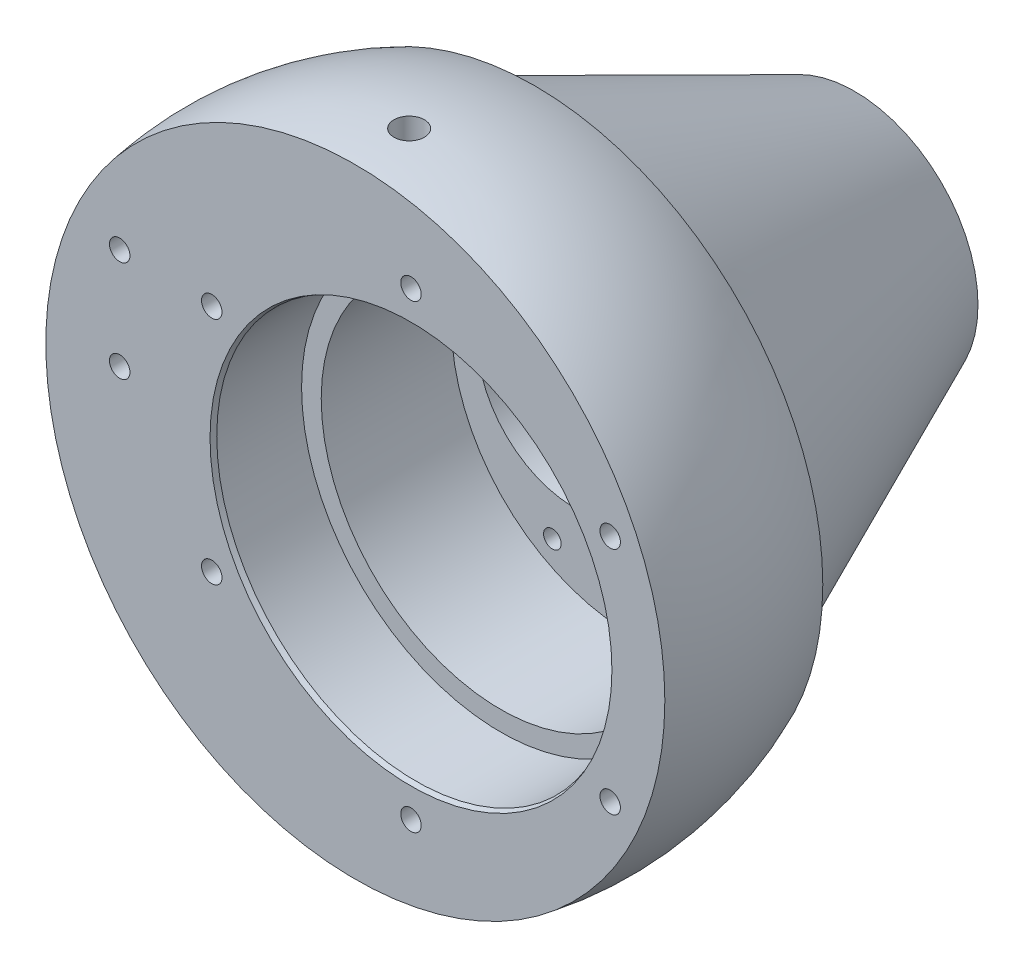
from build123d import *

# Parameters (mm, degrees)
SKETCH3_R                              = 50.8
ECCENTRIC_DEPTH                        = 62.23
SKETCH22_R                             = 2.8956
CLEVISHLS_8_32YARDLEY_TRISERTS_DEPTH   = 10.16
SKETCH23_R                             = 4.3053
F_25_20_YARDLEY_TRISERTS_DEPTH         = 15.24
SKETCH24_R                             = 56.3562754
SKETCH24_R_2                           = 50.8
CUT_EXTRUDE3_DEPTH                     = 25.4
CHAMFER2_SIZE                          = 1.395718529
CHAMFER2_SIZE2                         = 0.508
SKETCH25_R                             = 2.8956
MOTORHSGHLS_8_32YARDLEY_TRISERTS_DEPTH = 10.16
SKETCH26_R                             = 2.4892
MOTORPLT_6_32YARDLEY_TRISERTS_DEPTH    = 8.636
CHAMFER3_SIZE                          = 0.762
CUT_EXTRUDE4_DEPTH                     = 197.892263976
CUT_EXTRUDE4_DEPTH_BACK                = 197.892263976
SKETCH27_W                             = 50.8
SKETCH27_H                             = 127
SKETCH28_R                             = 20.675
CUT_EXTRUDE5_DEPTH                     = 190.086305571
CHAMFER4_SIZE                          = 1.016
CIRPATTERN1_COUNT                      = 6


with BuildPart() as part:
    # Sketch2 → Base-Revolve (revolve)
    with BuildSketch(Plane(origin=(0, 0, 0), x_dir=(0, 0, -1), z_dir=(1, 0, 0)), mode=Mode.PRIVATE) as base_revolve_sk:
        with BuildLine():
            Line((0, 27.78125), (0, 87.58397342))
            ThreePointArc((0, 87.58397342), (25.848757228, 88.264739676), (50.8, 81.478195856))
            Line((50.8, 81.478195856), (50.8, 75.184))
            Line((50.8, 75.184), (151.5872, 30.31744))
            Line((151.5872, 30.31744), (151.5872, 10.3124))
            Line((151.5872, 10.3124), (148.9456, 10.3124))
            Line((148.9456, 10.3124), (148.9456, 10.9474))
            Line((148.9456, 10.9474), (147.7772, 10.9474))
            Line((147.7772, 10.9474), (147.7772, 10.3124))
            Line((147.7772, 10.3124), (146.76556372, 10.3124))
            Line((146.76556372, 10.3124), (144.6022, 9.525))
            Line((144.6022, 9.525), (139.7, 9.525))
            Line((139.7, 9.525), (139.7, 6.3754))
            Line((139.7, 6.3754), (135.7122, 6.3754))
            Line((135.7122, 6.3754), (135.7122, 10.9982))
            Line((135.7122, 10.9982), (128.6002, 10.9982))
            Line((128.6002, 10.9982), (128.6002, 27.78125))
            Line((128.6002, 27.78125), (0, 27.78125))
        make_face()
    revolve(base_revolve_sk.sketch.rotate(Axis((0, 0, 0), (0, 0, -1)), 90), axis=Axis((0, 0, 0), (0, 0, -1)))

    # Sketch3 → Eccentric (cut)
    with BuildSketch(Plane.XY):
        with Locations((15.748, 0)):
            Circle(SKETCH3_R)
    extrude(amount=-ECCENTRIC_DEPTH, mode=Mode.SUBTRACT)

    # Sketch22 → ClevisHls_8-32Yardley Triserts (cut)
    with BuildSketch(Plane.XY):
        with Locations(Location((-66.675, 33.3375, 0), (0, 0, 180))):
            Circle(SKETCH22_R)
        with Locations(Location((-66.675, 4.7625, 0), (0, 0, 180))):
            Circle(SKETCH22_R)
    extrude(amount=-CLEVISHLS_8_32YARDLEY_TRISERTS_DEPTH, mode=Mode.SUBTRACT)

    # Sketch23 → 25-20 Yardley Triserts (cut)
    with BuildSketch(Plane(origin=(0, 88.9, 0), x_dir=(-1, 0, 0), z_dir=(0, 1, 0))):
        with Locations(Location((0, -15.24, 0), (0, 0, 90))):
            Circle(SKETCH23_R)
    f_25_20_yardley_triserts = extrude(amount=-F_25_20_YARDLEY_TRISERTS_DEPTH, mode=Mode.SUBTRACT)

    # Mirror1: 25-20 Yardley Triserts across plane
    add(f_25_20_yardley_triserts.mirror(Plane.ZX), mode=Mode.SUBTRACT)

    # Sketch24 → Cut-Extrude3 (cut)
    with BuildSketch(Plane.XY):
        with Locations((15.748, 0)):
            Circle(SKETCH24_R)
        with Locations((15.748, 0)):
            Circle(SKETCH24_R_2, mode=Mode.SUBTRACT)
    extrude(amount=-CUT_EXTRUDE3_DEPTH, mode=Mode.SUBTRACT)

    # Chamfer2
    chamfer2_edges = [part.edges().sort_by_distance(p)[0] for p in [
        (-40.6082754, 0, 0),
    ]]
    chamfer2_side = [part.faces().sort_by_distance(p)[0] for p in [
        (-40.6082754, 0, -12.7),
    ]]
    chamfer(chamfer2_edges, length=CHAMFER2_SIZE, length2=CHAMFER2_SIZE2, reference=chamfer2_side[0])

    # Sketch25 → MotorHsgHls_8-32Yardley Triserts (cut)
    with BuildSketch(Plane.XY):
        with Locations((72.115428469, -32.54375)):
            Circle(SKETCH25_R)
        with Locations((15.748, -65.0875)):
            Circle(SKETCH25_R)
        with Locations((-40.619428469, -32.54375)):
            Circle(SKETCH25_R)
        with Locations((-40.619428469, 32.54375)):
            Circle(SKETCH25_R)
        with Locations((15.748, 65.0875)):
            Circle(SKETCH25_R)
        with Locations((72.115428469, 32.54375)):
            Circle(SKETCH25_R)
    extrude(amount=-MOTORHSGHLS_8_32YARDLEY_TRISERTS_DEPTH, mode=Mode.SUBTRACT)

    # Sketch26 → MotorPlt_6-32Yardley Triserts (cut)
    with BuildSketch(Plane.XY.offset(-62.23)):
        with Locations(Location((37.973, -38.494829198, 0), (0, 0, 180))):
            Circle(SKETCH26_R)
        with Locations(Location((37.973, 38.494829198, 0), (0, 0, 180))):
            Circle(SKETCH26_R)
        with Locations((-6.477, -38.494829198)):
            Circle(SKETCH26_R)
        with Locations((60.198, 0)):
            Circle(SKETCH26_R)
        with Locations((-6.477, 38.494829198)):
            Circle(SKETCH26_R)
    extrude(amount=-MOTORPLT_6_32YARDLEY_TRISERTS_DEPTH, mode=Mode.SUBTRACT)

    # Chamfer3
    chamfer3_edges = [part.edges().sort_by_distance(p)[0] for p in [
        (-10.3124, 0, -151.5872),
    ]]
    chamfer(chamfer3_edges, length=CHAMFER3_SIZE)

    # Sketch27 → Cut-Extrude4 (cut, two sides: drawn at the far end of the back side and taken through both)
    with BuildSketch(Plane(origin=(0, 0, 0), x_dir=(0, 0, -1), z_dir=(1, 0, 0)).offset(-CUT_EXTRUDE4_DEPTH_BACK)):
        with Locations((166.7002, 0)):
            Rectangle(SKETCH27_W, SKETCH27_H)
    extrude(amount=CUT_EXTRUDE4_DEPTH + CUT_EXTRUDE4_DEPTH_BACK, mode=Mode.SUBTRACT)

    # Sketch28 → Cut-Extrude5 (cut, through all)
    with BuildSketch(Plane(origin=(0, 0, -141.3002), x_dir=(-1, 0, 0), z_dir=(0, 0, -1))):
        Circle(SKETCH28_R)
    extrude(amount=-CUT_EXTRUDE5_DEPTH, mode=Mode.SUBTRACT)

    # Chamfer4
    chamfer4_edges = [part.edges().sort_by_distance(p)[0] for p in [
        (20.675, 0, -141.3002),
    ]]
    chamfer(chamfer4_edges, length=CHAMFER4_SIZE)

    # Sketch29 → SealHsg_8-32YardleyShort (revolve, cut)
    with BuildSketch(Plane(origin=(0, 25.4, -141.3002), x_dir=(0, 1, 0), z_dir=(1, 0, 0))):
        Polygon((0, 0), (0, 9.677860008), (2.8956, 7.938008), (2.8956, 0), align=None)
    sealhsg_8_32yardleyshort = revolve(axis=Axis((0, 25.4, -147.6502), (0, 0, 1)), mode=Mode.SUBTRACT)

    # CirPattern1: SealHsg_8-32YardleyShort ×6 about axis
    cirpattern1_axis = Axis((0, 0, 0), (0, 0, 1))
    for i in range(1, CIRPATTERN1_COUNT):
        add(sealhsg_8_32yardleyshort.rotate(cirpattern1_axis, i * 360 / CIRPATTERN1_COUNT), mode=Mode.SUBTRACT)


solid = part.part
